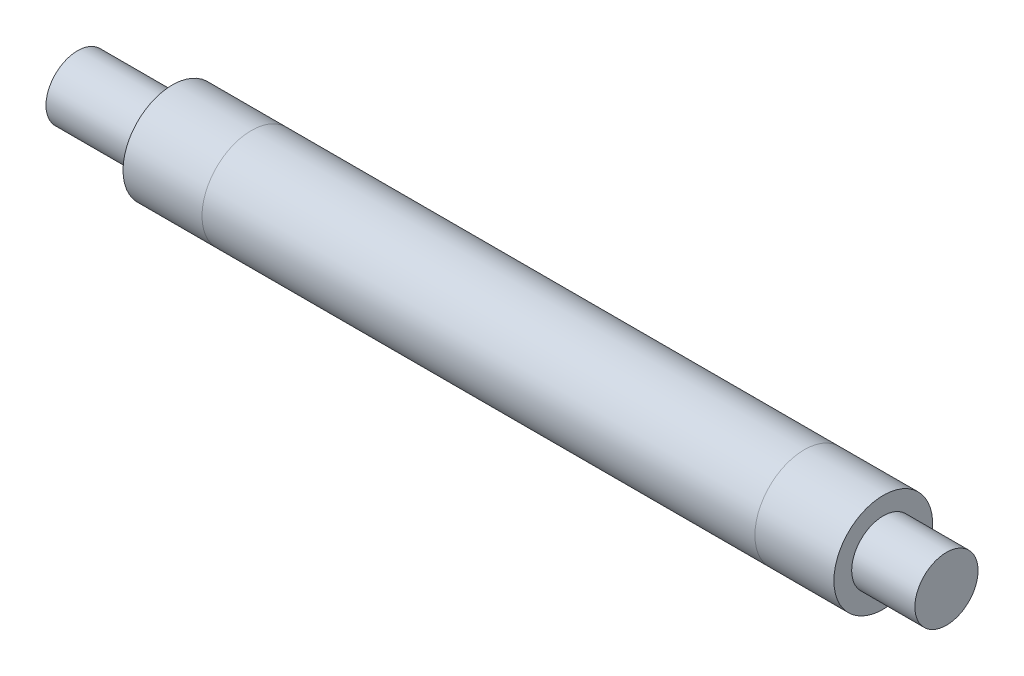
from build123d import *


with BuildPart() as part:
    # Sketch1 → Revolve1 (revolve)
    with BuildSketch(Plane.XY, mode=Mode.PRIVATE) as revolve1_sk:
        Polygon((0, 0), (0, 2), (6, 2), (6, 3.125), (51, 3.125), (51, 2), (55, 2), (55, 0), align=None)
    revolve(revolve1_sk.sketch.rotate(Axis((0, 0, 0), (1, 0, 0)), 90), axis=Axis((0, 0, 0), (1, 0, 0)))


solid = part.part
